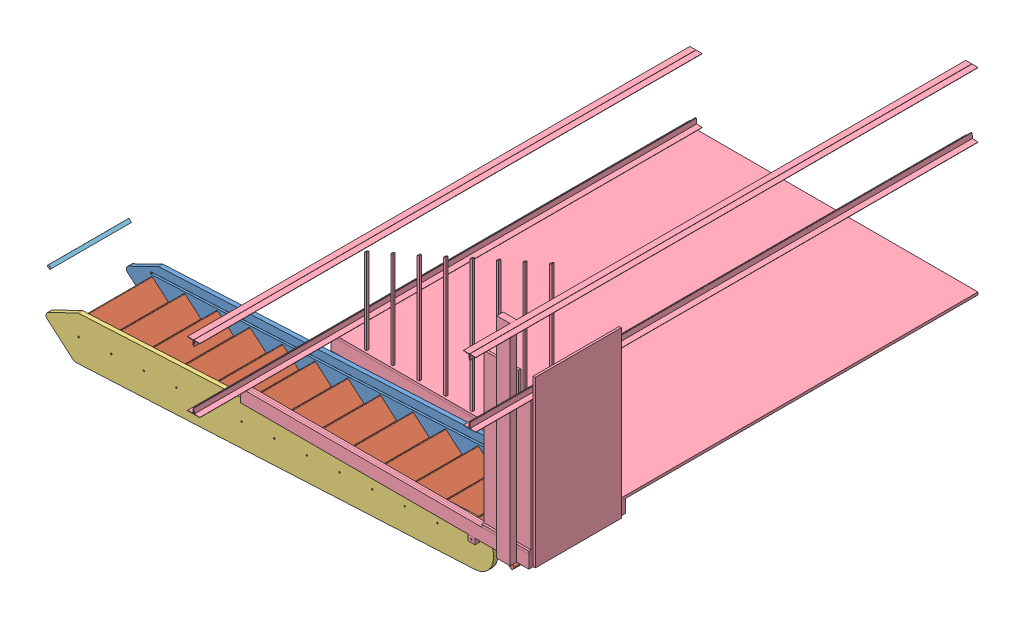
SolidWorks assembly Echelle_Toboggan.SLDASM, configuration Default (file format 12000). Lengths in mm.
Overall size (3512.78 1926.03 3500).
5 component instances, 5 part files, 4 mates.
Components (placement in the parent):
- Limon-1: Limon.SLDPRT [Default] at (-407.7692 -157.9999 25) x (0.99872 0.050582 0) z (0 0 1) size (3320.26 305 30)
- Marches-1: Marches.SLDPRT [Default] at (-407.7692 -157.9999 40) x (0.99872 0.050582 0) z (0 0 1) size (3320.26 305 560)
- Limon_Droit-1: Limon_Droit.SLDPRT [Default] at (-407.7692 -157.9999 585) x (0.99872 0.050582 0) z (0 0 1) size (3320.26 305 30)
- Pente-1: Pente.SLDPRT [Default] at origin size (2109.76 1926.03 3500)
- latte ondulé principe-1: latte ondulé principe.SLDPRT [Default] at (-5185.7252 2175.4062 127.7706) x (-0.692172 0.721732 0) z (0 0 1) size (24 14 560)
Mates (geometry in assembly coordinates):
- Coincident1: coincident anti-aligned: plane of Limon-1 through (-384.5342 -200.1612 10) normal (0 0 -1)
- ProfileCenter2: profile center anti-aligned: plane of Limon-1 through (-384.5342 -200.1612 25) normal (0 0 1); plane of Marches-1 through (-407.7692 -157.9999 25) normal (0 0 -1)
- ProfileCenter3: profile center anti-aligned: plane of Limon_Droit-1 through (-384.5342 -200.1612 585) normal (0 0 -1); plane of Marches-1 through (-407.7692 -157.9999 585) normal (0 0 1)
- Concentric1: concentric aligned: cylinder of Pente-1 through (-407.7692 -157.9999 535.9688) axis (0 0 1) radius 5; cylinder of Limon_Droit-1 through (-407.7692 -157.9999 570) axis (0 0 1) radius 4
